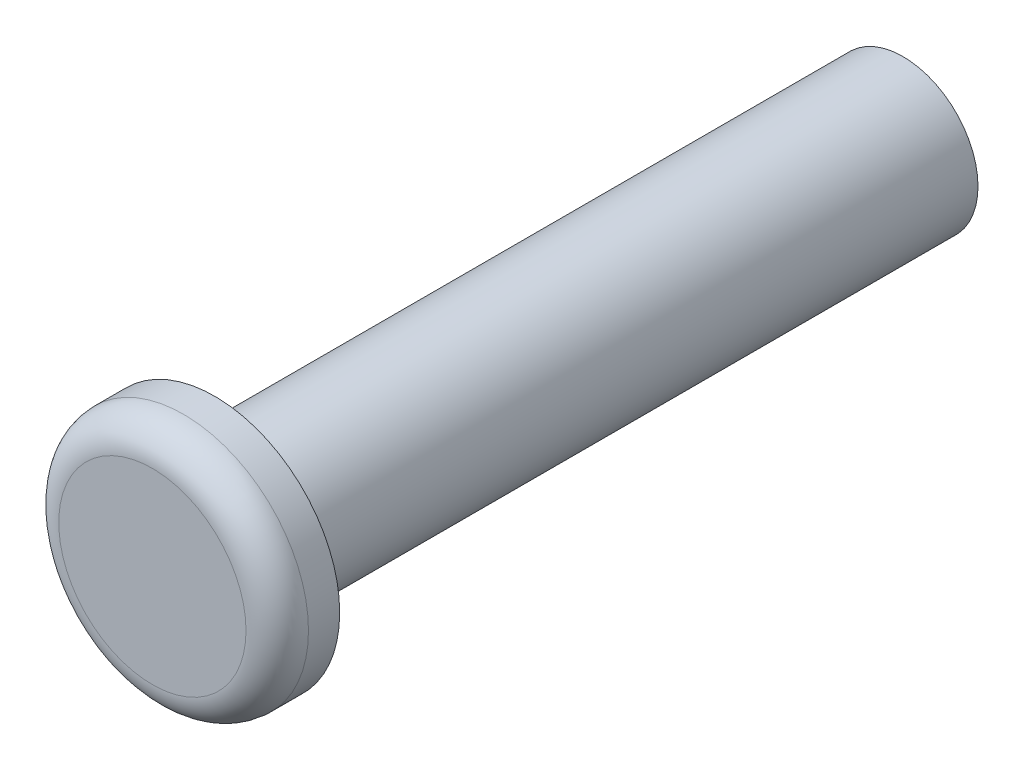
ISO-10303-21;
HEADER;
FILE_DESCRIPTION(('STEP AP214'),'2;1');
FILE_NAME('part.step','',(''),(''),'','','');
FILE_SCHEMA(('AUTOMOTIVE_DESIGN { 1 0 10303 214 1 1 1 1 }'));
ENDSEC;
DATA;
#1=APPLICATION_CONTEXT('core data for automotive mechanical design processes');
#2=APPLICATION_PROTOCOL_DEFINITION('international standard','automotive_design',2000,#1);
#3=PRODUCT_CONTEXT('',#1,'mechanical');
#4=PRODUCT('Part','Part','',(#3));
#5=PRODUCT_RELATED_PRODUCT_CATEGORY('part','',(#4));
#6=PRODUCT_DEFINITION_FORMATION('','',#4);
#7=PRODUCT_DEFINITION_CONTEXT('part definition',#1,'design');
#8=PRODUCT_DEFINITION('design','',#6,#7);
#9=PRODUCT_DEFINITION_SHAPE('','',#8);
#10=(LENGTH_UNIT() NAMED_UNIT(*) SI_UNIT(.MILLI.,.METRE.));
#11=(NAMED_UNIT(*) PLANE_ANGLE_UNIT() SI_UNIT($,.RADIAN.));
#12=(NAMED_UNIT(*) SI_UNIT($,.STERADIAN.) SOLID_ANGLE_UNIT());
#13=UNCERTAINTY_MEASURE_WITH_UNIT(LENGTH_MEASURE(1.E-05),#10,'distance_accuracy_value','');
#14=(GEOMETRIC_REPRESENTATION_CONTEXT(3) GLOBAL_UNCERTAINTY_ASSIGNED_CONTEXT((#13)) GLOBAL_UNIT_ASSIGNED_CONTEXT((#10,
#11,#12)) REPRESENTATION_CONTEXT('',''));
#15=CARTESIAN_POINT('',(0.,0.,0.));
#16=DIRECTION('',(0.,0.,1.));
#17=DIRECTION('',(1.,0.,0.));
#18=AXIS2_PLACEMENT_3D('',#15,#16,#17);
#19=CARTESIAN_POINT('',(0.,0.,-35.));
#20=DIRECTION('',(0.,0.,1.));
#21=DIRECTION('',(1.,0.,0.));
#22=AXIS2_PLACEMENT_3D('',#19,#20,#21);
#23=CYLINDRICAL_SURFACE('',#22,3.81);
#24=CARTESIAN_POINT('',(0.,0.,-35.));
#25=DIRECTION('',(0.,0.,1.));
#26=DIRECTION('',(1.,0.,0.));
#27=AXIS2_PLACEMENT_3D('',#24,#25,#26);
#28=CIRCLE('',#27,3.81);
#29=CARTESIAN_POINT('',(3.81,0.,-35.));
#30=VERTEX_POINT('',#29);
#31=EDGE_CURVE('E36',#30,#30,#28,.T.);
#32=ORIENTED_EDGE('',*,*,#31,.T.);
#33=EDGE_LOOP('',(#32));
#34=FACE_BOUND('',#33,.T.);
#35=CARTESIAN_POINT('',(0.,0.,0.));
#36=DIRECTION('',(0.,0.,1.));
#37=DIRECTION('',(1.,0.,0.));
#38=AXIS2_PLACEMENT_3D('',#35,#36,#37);
#39=CIRCLE('',#38,3.81);
#40=CARTESIAN_POINT('',(3.81,0.,0.));
#41=VERTEX_POINT('',#40);
#42=EDGE_CURVE('E40',#41,#41,#39,.T.);
#43=ORIENTED_EDGE('',*,*,#42,.F.);
#44=EDGE_LOOP('',(#43));
#45=FACE_BOUND('',#44,.T.);
#46=ADVANCED_FACE('F26',(#34,#45),#23,.T.);
#47=CARTESIAN_POINT('',(0.,0.,-35.));
#48=DIRECTION('',(0.,0.,1.));
#49=DIRECTION('',(1.,0.,0.));
#50=AXIS2_PLACEMENT_3D('',#47,#48,#49);
#51=PLANE('',#50);
#52=ORIENTED_EDGE('',*,*,#31,.F.);
#53=EDGE_LOOP('',(#52));
#54=FACE_BOUND('',#53,.T.);
#55=ADVANCED_FACE('F67',(#54),#51,.F.);
#56=CARTESIAN_POINT('',(0.,0.,3.175));
#57=DIRECTION('',(0.,0.,-1.));
#58=DIRECTION('',(-1.,0.,0.));
#59=AXIS2_PLACEMENT_3D('',#56,#57,#58);
#60=CYLINDRICAL_SURFACE('',#59,6.35);
#61=CARTESIAN_POINT('',(0.,0.,1.5875));
#62=DIRECTION('',(0.,0.,1.));
#63=DIRECTION('',(1.,0.,0.));
#64=AXIS2_PLACEMENT_3D('',#61,#62,#63);
#65=CIRCLE('',#64,6.35);
#66=CARTESIAN_POINT('',(6.35,0.,1.5875));
#67=VERTEX_POINT('',#66);
#68=EDGE_CURVE('E10',#67,#67,#65,.F.);
#69=ORIENTED_EDGE('',*,*,#68,.T.);
#70=EDGE_LOOP('',(#69));
#71=FACE_BOUND('',#70,.T.);
#72=CARTESIAN_POINT('',(0.,0.,0.));
#73=DIRECTION('',(0.,0.,1.));
#74=DIRECTION('',(1.,0.,0.));
#75=AXIS2_PLACEMENT_3D('',#72,#73,#74);
#76=CIRCLE('',#75,6.35);
#77=CARTESIAN_POINT('',(6.35,0.,0.));
#78=VERTEX_POINT('',#77);
#79=EDGE_CURVE('E45',#78,#78,#76,.T.);
#80=ORIENTED_EDGE('',*,*,#79,.T.);
#81=EDGE_LOOP('',(#80));
#82=FACE_BOUND('',#81,.T.);
#83=ADVANCED_FACE('F49',(#71,#82),#60,.T.);
#84=CARTESIAN_POINT('',(0.,0.,3.175));
#85=DIRECTION('',(0.,0.,1.));
#86=DIRECTION('',(1.,0.,0.));
#87=AXIS2_PLACEMENT_3D('',#84,#85,#86);
#88=PLANE('',#87);
#89=CARTESIAN_POINT('',(0.,0.,3.175));
#90=DIRECTION('',(0.,0.,1.));
#91=DIRECTION('',(1.,0.,0.));
#92=AXIS2_PLACEMENT_3D('',#89,#90,#91);
#93=CIRCLE('',#92,4.7625);
#94=CARTESIAN_POINT('',(4.7625,0.,3.175));
#95=VERTEX_POINT('',#94);
#96=EDGE_CURVE('E32',#95,#95,#93,.T.);
#97=ORIENTED_EDGE('',*,*,#96,.T.);
#98=EDGE_LOOP('',(#97));
#99=FACE_BOUND('',#98,.T.);
#100=ADVANCED_FACE('F54',(#99),#88,.T.);
#101=CARTESIAN_POINT('',(0.,0.,0.));
#102=DIRECTION('',(0.,0.,1.));
#103=DIRECTION('',(1.,0.,0.));
#104=AXIS2_PLACEMENT_3D('',#101,#102,#103);
#105=PLANE('',#104);
#106=ORIENTED_EDGE('',*,*,#42,.T.);
#107=EDGE_LOOP('',(#106));
#108=FACE_BOUND('',#107,.T.);
#109=ORIENTED_EDGE('',*,*,#79,.F.);
#110=EDGE_LOOP('',(#109));
#111=FACE_BOUND('',#110,.T.);
#112=ADVANCED_FACE('F51',(#108,#111),#105,.F.);
#113=CARTESIAN_POINT('',(0.,0.,1.5875));
#114=DIRECTION('',(0.,0.,1.));
#115=DIRECTION('',(1.,0.,0.));
#116=AXIS2_PLACEMENT_3D('',#113,#114,#115);
#117=TOROIDAL_SURFACE('',#116,4.7625,1.5875);
#118=ORIENTED_EDGE('',*,*,#68,.F.);
#119=EDGE_LOOP('',(#118));
#120=FACE_BOUND('',#119,.T.);
#121=ORIENTED_EDGE('',*,*,#96,.F.);
#122=EDGE_LOOP('',(#121));
#123=FACE_BOUND('',#122,.T.);
#124=ADVANCED_FACE('F53',(#120,#123),#117,.T.);
#125=CLOSED_SHELL('',(#46,#55,#83,#100,#112,#124));
#126=MANIFOLD_SOLID_BREP('B2',#125);
#127=ADVANCED_BREP_SHAPE_REPRESENTATION('',(#18,#126),#14);
#128=SHAPE_DEFINITION_REPRESENTATION(#9,#127);
ENDSEC;
END-ISO-10303-21;
